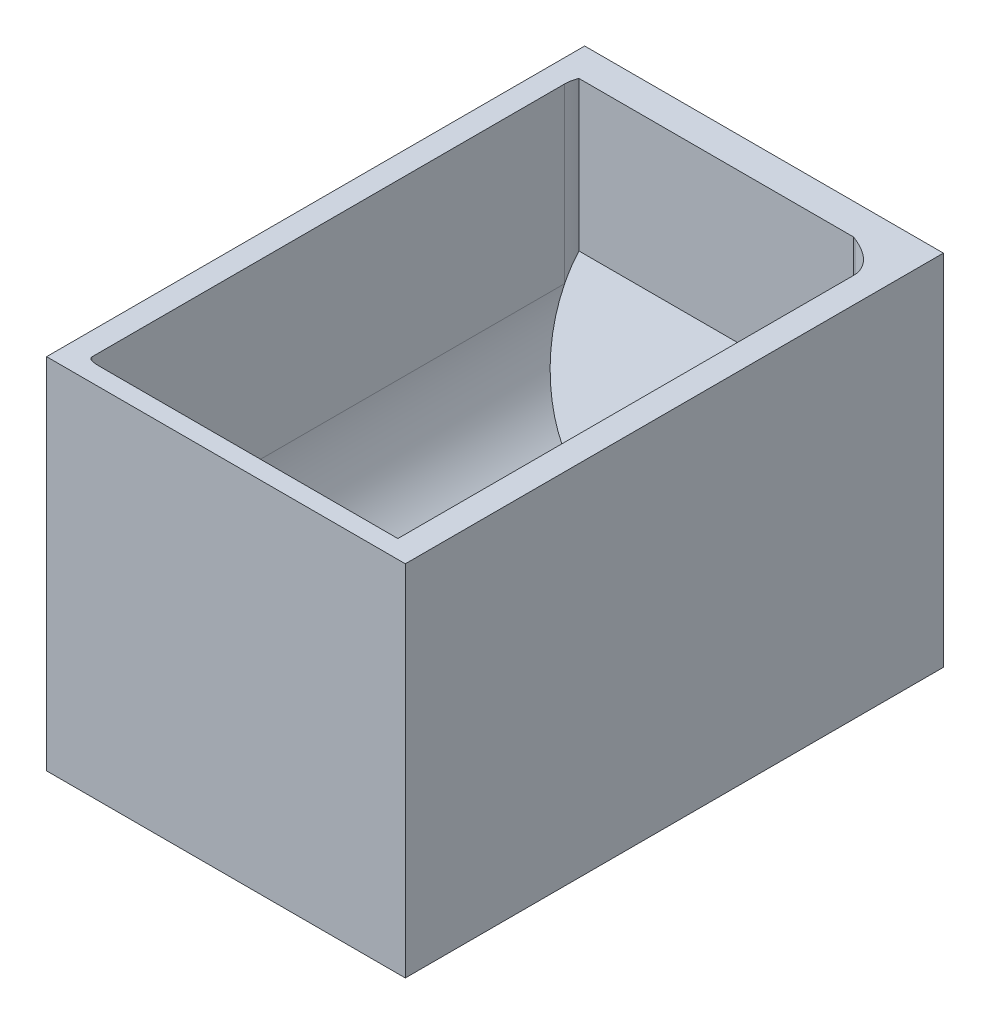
ISO-10303-21;
HEADER;
FILE_DESCRIPTION(('STEP AP214'),'2;1');
FILE_NAME('part.step','',(''),(''),'','','');
FILE_SCHEMA(('AUTOMOTIVE_DESIGN { 1 0 10303 214 1 1 1 1 }'));
ENDSEC;
DATA;
#1=APPLICATION_CONTEXT('core data for automotive mechanical design processes');
#2=APPLICATION_PROTOCOL_DEFINITION('international standard','automotive_design',2000,#1);
#3=PRODUCT_CONTEXT('',#1,'mechanical');
#4=PRODUCT('Part','Part','',(#3));
#5=PRODUCT_RELATED_PRODUCT_CATEGORY('part','',(#4));
#6=PRODUCT_DEFINITION_FORMATION('','',#4);
#7=PRODUCT_DEFINITION_CONTEXT('part definition',#1,'design');
#8=PRODUCT_DEFINITION('design','',#6,#7);
#9=PRODUCT_DEFINITION_SHAPE('','',#8);
#10=(LENGTH_UNIT() NAMED_UNIT(*) SI_UNIT(.MILLI.,.METRE.));
#11=(NAMED_UNIT(*) PLANE_ANGLE_UNIT() SI_UNIT($,.RADIAN.));
#12=(NAMED_UNIT(*) SI_UNIT($,.STERADIAN.) SOLID_ANGLE_UNIT());
#13=UNCERTAINTY_MEASURE_WITH_UNIT(LENGTH_MEASURE(1.E-05),#10,'distance_accuracy_value','');
#14=(GEOMETRIC_REPRESENTATION_CONTEXT(3) GLOBAL_UNCERTAINTY_ASSIGNED_CONTEXT((#13)) GLOBAL_UNIT_ASSIGNED_CONTEXT((#10,
#11,#12)) REPRESENTATION_CONTEXT('',''));
#15=CARTESIAN_POINT('',(0.,0.,0.));
#16=DIRECTION('',(0.,0.,1.));
#17=DIRECTION('',(1.,0.,0.));
#18=AXIS2_PLACEMENT_3D('',#15,#16,#17);
#19=CARTESIAN_POINT('',(42.6472601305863,-13.0230460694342,69.9501499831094));
#20=DIRECTION('',(0.,0.,-1.));
#21=DIRECTION('',(-1.,0.,0.));
#22=AXIS2_PLACEMENT_3D('',#19,#20,#21);
#23=PLANE('',#22);
#24=DIRECTION('',(0.,1.,0.));
#25=VECTOR('',#24,1.);
#26=CARTESIAN_POINT('',(-40.1719406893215,-13.0230460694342,69.9501499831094));
#27=LINE('',#26,#25);
#28=CARTESIAN_POINT('',(-40.1719406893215,-13.0230460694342,69.9501499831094));
#29=VERTEX_POINT('',#28);
#30=CARTESIAN_POINT('',(-40.1719406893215,50.,69.9501499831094));
#31=VERTEX_POINT('',#30);
#32=EDGE_CURVE('E118',#29,#31,#27,.T.);
#33=ORIENTED_EDGE('',*,*,#32,.T.);
#34=DIRECTION('',(1.,0.,0.));
#35=VECTOR('',#34,1.);
#36=CARTESIAN_POINT('',(-50.,50.,69.9501499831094));
#37=LINE('',#36,#35);
#38=CARTESIAN_POINT('',(42.6472601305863,50.,69.9501499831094));
#39=VERTEX_POINT('',#38);
#40=EDGE_CURVE('E243',#31,#39,#37,.T.);
#41=ORIENTED_EDGE('',*,*,#40,.T.);
#42=DIRECTION('',(0.,1.,0.));
#43=VECTOR('',#42,1.);
#44=CARTESIAN_POINT('',(42.6472601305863,-13.0230460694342,69.9501499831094));
#45=LINE('',#44,#43);
#46=CARTESIAN_POINT('',(42.6472601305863,-13.0230460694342,69.9501499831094));
#47=VERTEX_POINT('',#46);
#48=EDGE_CURVE('E114',#47,#39,#45,.T.);
#49=ORIENTED_EDGE('',*,*,#48,.F.);
#50=DIRECTION('',(1.,0.,0.));
#51=VECTOR('',#50,1.);
#52=CARTESIAN_POINT('',(0.,-13.0230460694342,69.9501499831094));
#53=LINE('',#52,#51);
#54=EDGE_CURVE('E270',#29,#47,#53,.T.);
#55=ORIENTED_EDGE('',*,*,#54,.F.);
#56=EDGE_LOOP('',(#33,#41,#49,#55));
#57=FACE_BOUND('',#56,.T.);
#58=ADVANCED_FACE('F41',(#57),#23,.T.);
#59=CARTESIAN_POINT('',(34.2275740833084,7.81878440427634,-66.1062454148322));
#60=CARTESIAN_POINT('',(39.7791899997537,3.48723255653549,-63.9094381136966));
#61=CARTESIAN_POINT('',(42.8680522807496,-2.84061940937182,-60.700179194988));
#62=CARTESIAN_POINT('',(42.8680522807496,-9.88212355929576,-57.1289815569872));
#63=(BOUNDED_CURVE() B_SPLINE_CURVE(3,(#59,#60,#61,#62),.UNSPECIFIED.,.F.,
.F.) B_SPLINE_CURVE_WITH_KNOTS((4,4),(0.,1.),
.UNSPECIFIED.) CURVE() GEOMETRIC_REPRESENTATION_ITEM() RATIONAL_B_SPLINE_CURVE((1.,
0.932433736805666,0.932433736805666,1.)) REPRESENTATION_ITEM(''));
#64=DIRECTION('',(0.,1.,0.));
#65=VECTOR('',#64,1.);
#66=SURFACE_OF_LINEAR_EXTRUSION('',#63,#65);
#67=DIRECTION('',(0.,1.,0.));
#68=VECTOR('',#67,1.);
#69=CARTESIAN_POINT('',(42.8680522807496,-9.88212355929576,-57.1289815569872));
#70=LINE('',#69,#68);
#71=CARTESIAN_POINT('',(42.8680522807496,-9.88212355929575,-57.1289815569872));
#72=VERTEX_POINT('',#71);
#73=CARTESIAN_POINT('',(42.8680522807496,50.,-57.1289815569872));
#74=VERTEX_POINT('',#73);
#75=EDGE_CURVE('E135',#72,#74,#70,.T.);
#76=ORIENTED_EDGE('',*,*,#75,.T.);
#77=CARTESIAN_POINT('',(42.8680522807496,50.,-57.1289815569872));
#78=CARTESIAN_POINT('',(42.8680548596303,50.,-57.2180878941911));
#79=CARTESIAN_POINT('',(42.8659892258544,50.,-57.3071810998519));
#80=CARTESIAN_POINT('',(42.8577508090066,50.,-57.4851717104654));
#81=CARTESIAN_POINT('',(42.8515782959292,50.,-57.5740691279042));
#82=CARTESIAN_POINT('',(42.826963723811,50.,-57.8400172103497));
#83=CARTESIAN_POINT('',(42.8024244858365,50.,-58.016539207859));
#84=CARTESIAN_POINT('',(42.7380327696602,50.,-58.3649748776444));
#85=CARTESIAN_POINT('',(42.6983289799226,50.,-58.5369164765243));
#86=CARTESIAN_POINT('',(42.6045419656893,50.,-58.8768520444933));
#87=CARTESIAN_POINT('',(42.5504559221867,50.,-59.0448452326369));
#88=CARTESIAN_POINT('',(42.4292826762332,50.,-59.375372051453));
#89=CARTESIAN_POINT('',(42.3622427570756,50.,-59.5379230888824));
#90=CARTESIAN_POINT('',(42.2163084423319,50.,-59.8575490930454));
#91=CARTESIAN_POINT('',(42.1374145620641,50.,-60.0146242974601));
#92=CARTESIAN_POINT('',(41.884474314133,50.,-60.4776783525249));
#93=CARTESIAN_POINT('',(41.6943483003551,50.,-60.7750139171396));
#94=CARTESIAN_POINT('',(41.3681110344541,50.,-61.2248383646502));
#95=CARTESIAN_POINT('',(41.2429815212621,50.,-61.3855839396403));
#96=CARTESIAN_POINT('',(40.9829813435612,50.,-61.6991890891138));
#97=CARTESIAN_POINT('',(40.8481051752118,50.,-61.8520441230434));
#98=CARTESIAN_POINT('',(40.5700103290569,50.,-62.1499763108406));
#99=CARTESIAN_POINT('',(40.4267899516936,50.,-62.2950518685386));
#100=CARTESIAN_POINT('',(40.1322700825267,50.,-62.5785682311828));
#101=CARTESIAN_POINT('',(39.9809269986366,50.,-62.7169636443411));
#102=CARTESIAN_POINT('',(39.6719875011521,50.,-62.986479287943));
#103=CARTESIAN_POINT('',(39.5143928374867,50.,-63.1176015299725));
#104=CARTESIAN_POINT('',(39.1937519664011,50.,-63.3729564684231));
#105=CARTESIAN_POINT('',(39.0307061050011,50.,-63.4971896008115));
#106=CARTESIAN_POINT('',(38.6261507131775,50.,-63.7930252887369));
#107=CARTESIAN_POINT('',(38.3820410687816,50.,-63.9610784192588));
#108=CARTESIAN_POINT('',(37.885522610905,50.,-64.2846038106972));
#109=CARTESIAN_POINT('',(37.6331102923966,50.,-64.4400706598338));
#110=CARTESIAN_POINT('',(37.1212831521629,50.,-64.7393526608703));
#111=CARTESIAN_POINT('',(36.8618641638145,50.,-64.8831606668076));
#112=CARTESIAN_POINT('',(36.3427907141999,50.,-65.1569158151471));
#113=CARTESIAN_POINT('',(36.0832560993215,50.,-65.2870909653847));
#114=CARTESIAN_POINT('',(35.5597029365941,50.,-65.5375327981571));
#115=CARTESIAN_POINT('',(35.2956878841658,50.,-65.6578068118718));
#116=CARTESIAN_POINT('',(34.7641919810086,50.,-65.888891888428));
#117=CARTESIAN_POINT('',(34.4967194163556,50.,-65.9997219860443));
#118=CARTESIAN_POINT('',(34.2275740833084,50.,-66.1062454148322));
#119=B_SPLINE_CURVE_WITH_KNOTS('',3,(#77,#78,#79,#80,#81,#82,#83,#84,#85,#86,#87,#88,#89,#90,
#91,#92,#93,#94,#95,#96,#97,#98,#99,#100,#101,#102,#103,#104,#105,#106,#107,#108,#109,#110,#111,
#112,#113,#114,#115,#116,#117,#118),.UNSPECIFIED.,.F.,.F.,(4,2,2,2,2,2,2,2,2,2,2,2,2,2,2,2,2,2,
2,2,4),(0.,0.267269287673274,0.53452100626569,1.06838041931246,1.59713440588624,
2.12599210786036,2.65295468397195,3.1798943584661,4.23527389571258,4.84610165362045,
5.45727707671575,6.068577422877,6.68357186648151,7.2983953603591,7.91317990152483,
8.80181136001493,9.69082290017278,10.5803752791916,11.4512073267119,12.3213886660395,
13.1897724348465),.UNSPECIFIED.);
#120=CARTESIAN_POINT('',(34.2275740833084,50.,-66.1062454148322));
#121=VERTEX_POINT('',#120);
#122=EDGE_CURVE('E521',#74,#121,#119,.T.);
#123=ORIENTED_EDGE('',*,*,#122,.T.);
#124=DIRECTION('',(0.,1.,0.));
#125=VECTOR('',#124,1.);
#126=CARTESIAN_POINT('',(34.2275740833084,7.81878440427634,-66.1062454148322));
#127=LINE('',#126,#125);
#128=CARTESIAN_POINT('',(34.2275740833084,7.81878440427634,-66.1062454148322));
#129=VERTEX_POINT('',#128);
#130=EDGE_CURVE('E132',#129,#121,#127,.T.);
#131=ORIENTED_EDGE('',*,*,#130,.F.);
#132=CARTESIAN_POINT('',(20.4167482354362,-9.88212355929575,-57.1289815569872));
#133=DIRECTION('',(0.,0.45231772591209,0.891856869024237));
#134=DIRECTION('',(0.,-0.891856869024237,0.45231772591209));
#135=AXIS2_PLACEMENT_3D('',#132,#133,#134);
#136=ELLIPSE('',#135,25.1736627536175,22.4513040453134);
#137=EDGE_CURVE('E115',#72,#129,#136,.T.);
#138=ORIENTED_EDGE('',*,*,#137,.F.);
#139=EDGE_LOOP('',(#76,#123,#131,#138));
#140=FACE_BOUND('',#139,.T.);
#141=ADVANCED_FACE('F450',(#140),#66,.T.);
#142=CARTESIAN_POINT('',(42.8680522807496,-9.88212355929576,-57.1289815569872));
#143=DIRECTION('',(-1.,0.,0.));
#144=DIRECTION('',(0.,0.,1.));
#145=AXIS2_PLACEMENT_3D('',#142,#143,#144);
#146=PLANE('',#145);
#147=DIRECTION('',(0.,1.,0.));
#148=VECTOR('',#147,1.);
#149=CARTESIAN_POINT('',(42.8680522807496,-9.88212355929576,69.8935790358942));
#150=LINE('',#149,#148);
#151=CARTESIAN_POINT('',(42.8680522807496,-9.88212355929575,69.8935790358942));
#152=VERTEX_POINT('',#151);
#153=CARTESIAN_POINT('',(42.8680522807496,50.,69.8935790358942));
#154=VERTEX_POINT('',#153);
#155=EDGE_CURVE('E137',#152,#154,#150,.T.);
#156=ORIENTED_EDGE('',*,*,#155,.T.);
#157=DIRECTION('',(0.,0.,-1.));
#158=VECTOR('',#157,1.);
#159=CARTESIAN_POINT('',(42.8680522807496,50.,75.));
#160=LINE('',#159,#158);
#161=EDGE_CURVE('E242',#154,#74,#160,.T.);
#162=ORIENTED_EDGE('',*,*,#161,.T.);
#163=ORIENTED_EDGE('',*,*,#75,.F.);
#164=DIRECTION('',(0.,0.,-1.));
#165=VECTOR('',#164,1.);
#166=CARTESIAN_POINT('',(42.8680522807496,-9.88212355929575,75.001));
#167=LINE('',#166,#165);
#168=EDGE_CURVE('E262',#152,#72,#167,.T.);
#169=ORIENTED_EDGE('',*,*,#168,.F.);
#170=EDGE_LOOP('',(#156,#162,#163,#169));
#171=FACE_BOUND('',#170,.T.);
#172=ADVANCED_FACE('F229',(#171),#146,.T.);
#173=CARTESIAN_POINT('',(33.5815636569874,8.34381436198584,-66.3725217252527));
#174=CARTESIAN_POINT('',(33.7934064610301,8.16453425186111,-66.2815973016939));
#175=CARTESIAN_POINT('',(34.0087716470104,7.98950120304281,-66.1928268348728));
#176=CARTESIAN_POINT('',(34.2275740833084,7.81878440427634,-66.1062454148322));
#177=(BOUNDED_CURVE() B_SPLINE_CURVE(3,(#173,#174,#175,#176),.UNSPECIFIED.,.F.,
.F.) B_SPLINE_CURVE_WITH_KNOTS((4,4),(0.,1.),
.UNSPECIFIED.) CURVE() GEOMETRIC_REPRESENTATION_ITEM() RATIONAL_B_SPLINE_CURVE((1.,
0.999868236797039,0.999868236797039,1.)) REPRESENTATION_ITEM(''));
#178=DIRECTION('',(0.,1.,0.));
#179=VECTOR('',#178,1.);
#180=SURFACE_OF_LINEAR_EXTRUSION('',#177,#179);
#181=ORIENTED_EDGE('',*,*,#130,.T.);
#182=CARTESIAN_POINT('',(34.2275740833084,50.,-66.1062454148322));
#183=CARTESIAN_POINT('',(34.1596857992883,50.,-66.1331093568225));
#184=CARTESIAN_POINT('',(34.091914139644,50.,-66.1602686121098));
#185=CARTESIAN_POINT('',(33.9501833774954,50.,-66.2177975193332));
#186=CARTESIAN_POINT('',(33.8762485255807,50.,-66.2482269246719));
#187=CARTESIAN_POINT('',(33.7286771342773,50.,-66.3098206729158));
#188=CARTESIAN_POINT('',(33.6550406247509,50.,-66.3409850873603));
#189=CARTESIAN_POINT('',(33.5815636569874,50.,-66.3725217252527));
#190=B_SPLINE_CURVE_WITH_KNOTS('',3,(#182,#183,#184,#185,#186,#187,#188,#189),.UNSPECIFIED.,.F.,
.F.,(4,2,2,4),(0.,0.219030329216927,0.45888223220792,0.698757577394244),.UNSPECIFIED.);
#191=CARTESIAN_POINT('',(33.5815636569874,50.,-66.3725217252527));
#192=VERTEX_POINT('',#191);
#193=EDGE_CURVE('E500',#121,#192,#190,.T.);
#194=ORIENTED_EDGE('',*,*,#193,.T.);
#195=DIRECTION('',(0.,1.,0.));
#196=VECTOR('',#195,1.);
#197=CARTESIAN_POINT('',(33.5815636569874,8.34381436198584,-66.3725217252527));
#198=LINE('',#197,#196);
#199=CARTESIAN_POINT('',(33.5815636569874,8.34381436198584,-66.3725217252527));
#200=VERTEX_POINT('',#199);
#201=EDGE_CURVE('E129',#200,#192,#198,.T.);
#202=ORIENTED_EDGE('',*,*,#201,.F.);
#203=CARTESIAN_POINT('',(47.1063341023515,24.3250924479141,-74.4776511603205));
#204=DIRECTION('',(0.,0.45231772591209,0.891856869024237));
#205=DIRECTION('',(0.,-0.891856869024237,0.45231772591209));
#206=AXIS2_PLACEMENT_3D('',#203,#204,#205);
#207=ELLIPSE('',#206,23.4747411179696,20.9361091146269);
#208=EDGE_CURVE('E101',#129,#200,#207,.F.);
#209=ORIENTED_EDGE('',*,*,#208,.F.);
#210=EDGE_LOOP('',(#181,#194,#202,#209));
#211=FACE_BOUND('',#210,.T.);
#212=ADVANCED_FACE('F439',(#211),#180,.T.);
#213=CARTESIAN_POINT('',(-42.9839007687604,8.34381436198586,-66.3725217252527));
#214=DIRECTION('',(0.,0.,1.));
#215=DIRECTION('',(1.,0.,0.));
#216=AXIS2_PLACEMENT_3D('',#213,#214,#215);
#217=PLANE('',#216);
#218=ORIENTED_EDGE('',*,*,#201,.T.);
#219=DIRECTION('',(-1.,0.,0.));
#220=VECTOR('',#219,1.);
#221=CARTESIAN_POINT('',(-50.,50.,-66.3725217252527));
#222=LINE('',#221,#220);
#223=CARTESIAN_POINT('',(-42.9839007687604,50.,-66.3725217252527));
#224=VERTEX_POINT('',#223);
#225=EDGE_CURVE('E499',#192,#224,#222,.T.);
#226=ORIENTED_EDGE('',*,*,#225,.T.);
#227=DIRECTION('',(0.,1.,0.));
#228=VECTOR('',#227,1.);
#229=CARTESIAN_POINT('',(-42.9839007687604,8.34381436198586,-66.3725217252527));
#230=LINE('',#229,#228);
#231=CARTESIAN_POINT('',(-42.9839007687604,8.34381436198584,-66.3725217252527));
#232=VERTEX_POINT('',#231);
#233=EDGE_CURVE('E74',#232,#224,#230,.T.);
#234=ORIENTED_EDGE('',*,*,#233,.F.);
#235=DIRECTION('',(1.,0.,0.));
#236=VECTOR('',#235,1.);
#237=CARTESIAN_POINT('',(0.,8.34381436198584,-66.3725217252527));
#238=LINE('',#237,#236);
#239=EDGE_CURVE('E246',#232,#200,#238,.T.);
#240=ORIENTED_EDGE('',*,*,#239,.T.);
#241=EDGE_LOOP('',(#218,#226,#234,#240));
#242=FACE_BOUND('',#241,.T.);
#243=ADVANCED_FACE('F430',(#242),#217,.T.);
#244=CARTESIAN_POINT('',(-43.634459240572,1.78443318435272,-63.0458395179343));
#245=CARTESIAN_POINT('',(-43.634459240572,3.98879593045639,-64.1638130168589));
#246=CARTESIAN_POINT('',(-43.4168982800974,6.18239624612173,-65.2763281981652));
#247=CARTESIAN_POINT('',(-42.9839007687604,8.34381436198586,-66.3725217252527));
#248=(BOUNDED_CURVE() B_SPLINE_CURVE(3,(#244,#245,#246,#247),.UNSPECIFIED.,.F.,
.F.) B_SPLINE_CURVE_WITH_KNOTS((4,4),(0.,1.),
.UNSPECIFIED.) CURVE() GEOMETRIC_REPRESENTATION_ITEM() RATIONAL_B_SPLINE_CURVE((1.,
0.996745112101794,0.996745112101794,1.)) REPRESENTATION_ITEM(''));
#249=DIRECTION('',(0.,1.,0.));
#250=VECTOR('',#249,1.);
#251=SURFACE_OF_LINEAR_EXTRUSION('',#248,#250);
#252=ORIENTED_EDGE('',*,*,#233,.T.);
#253=CARTESIAN_POINT('',(-42.9839007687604,50.,-66.3725217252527));
#254=CARTESIAN_POINT('',(-43.0351918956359,50.,-66.2426697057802));
#255=CARTESIAN_POINT('',(-43.083773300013,50.,-66.1117684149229));
#256=CARTESIAN_POINT('',(-43.1752733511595,50.,-65.8479615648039));
#257=CARTESIAN_POINT('',(-43.2181903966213,50.,-65.7150554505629));
#258=CARTESIAN_POINT('',(-43.337966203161,50.,-65.3138247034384));
#259=CARTESIAN_POINT('',(-43.4059435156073,50.,-65.0427518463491));
#260=CARTESIAN_POINT('',(-43.4895740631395,50.,-64.6281417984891));
#261=CARTESIAN_POINT('',(-43.5146232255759,50.,-64.4864260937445));
#262=CARTESIAN_POINT('',(-43.5577474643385,50.,-64.2019604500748));
#263=CARTESIAN_POINT('',(-43.5758244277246,50.,-64.0592108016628));
#264=CARTESIAN_POINT('',(-43.6050048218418,50.,-63.7715780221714));
#265=CARTESIAN_POINT('',(-43.6160376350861,50.,-63.6266877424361));
#266=CARTESIAN_POINT('',(-43.630771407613,50.,-63.3364797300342));
#267=CARTESIAN_POINT('',(-43.6344695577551,50.,-63.1911618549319));
#268=CARTESIAN_POINT('',(-43.634459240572,50.0000000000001,-63.0458395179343));
#269=B_SPLINE_CURVE_WITH_KNOTS('',3,(#253,#254,#255,#256,#257,#258,#259,#260,#261,#262,#263,
#264,#265,#266,#267,#268),.UNSPECIFIED.,.F.,.F.,(4,2,2,2,2,2,2,4),(0.,0.418770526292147,
0.837659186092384,1.67467753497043,2.10627941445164,2.53776439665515,2.9735097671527,
3.40942199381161),.UNSPECIFIED.);
#270=CARTESIAN_POINT('',(-43.634459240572,50.,-63.0458395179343));
#271=VERTEX_POINT('',#270);
#272=EDGE_CURVE('E498',#224,#271,#269,.T.);
#273=ORIENTED_EDGE('',*,*,#272,.T.);
#274=DIRECTION('',(0.,1.,0.));
#275=VECTOR('',#274,1.);
#276=CARTESIAN_POINT('',(-43.634459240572,1.78443318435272,-63.0458395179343));
#277=LINE('',#276,#275);
#278=CARTESIAN_POINT('',(-43.634459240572,1.78443318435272,-63.0458395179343));
#279=VERTEX_POINT('',#278);
#280=EDGE_CURVE('E57',#279,#271,#277,.T.);
#281=ORIENTED_EDGE('',*,*,#280,.F.);
#282=CARTESIAN_POINT('',(-10.2410675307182,1.78443318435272,-63.0458395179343));
#283=DIRECTION('',(0.,0.45231772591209,0.891856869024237));
#284=DIRECTION('',(0.,-0.891856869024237,0.45231772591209));
#285=AXIS2_PLACEMENT_3D('',#282,#283,#284);
#286=ELLIPSE('',#285,37.4425458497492,33.3933917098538);
#287=EDGE_CURVE('E97',#232,#279,#286,.T.);
#288=ORIENTED_EDGE('',*,*,#287,.F.);
#289=EDGE_LOOP('',(#252,#273,#281,#288));
#290=FACE_BOUND('',#289,.T.);
#291=ADVANCED_FACE('F421',(#290),#251,.T.);
#292=CARTESIAN_POINT('',(-43.634459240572,1.78443318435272,68.684061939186));
#293=DIRECTION('',(1.,0.,0.));
#294=DIRECTION('',(0.,0.,-1.));
#295=AXIS2_PLACEMENT_3D('',#292,#293,#294);
#296=PLANE('',#295);
#297=ORIENTED_EDGE('',*,*,#280,.T.);
#298=DIRECTION('',(0.,0.,1.));
#299=VECTOR('',#298,1.);
#300=CARTESIAN_POINT('',(-43.634459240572,50.,75.));
#301=LINE('',#300,#299);
#302=CARTESIAN_POINT('',(-43.634459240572,50.,68.684061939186));
#303=VERTEX_POINT('',#302);
#304=EDGE_CURVE('E153',#271,#303,#301,.T.);
#305=ORIENTED_EDGE('',*,*,#304,.T.);
#306=DIRECTION('',(0.,1.,0.));
#307=VECTOR('',#306,1.);
#308=CARTESIAN_POINT('',(-43.634459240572,1.78443318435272,68.684061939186));
#309=LINE('',#308,#307);
#310=CARTESIAN_POINT('',(-43.634459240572,1.78443318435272,68.684061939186));
#311=VERTEX_POINT('',#310);
#312=EDGE_CURVE('E11',#311,#303,#309,.T.);
#313=ORIENTED_EDGE('',*,*,#312,.F.);
#314=DIRECTION('',(0.,0.,1.));
#315=VECTOR('',#314,1.);
#316=CARTESIAN_POINT('',(-43.634459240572,1.78443318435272,75.001));
#317=LINE('',#316,#315);
#318=EDGE_CURVE('E152',#279,#311,#317,.T.);
#319=ORIENTED_EDGE('',*,*,#318,.F.);
#320=EDGE_LOOP('',(#297,#305,#313,#319));
#321=FACE_BOUND('',#320,.T.);
#322=ADVANCED_FACE('F161',(#321),#296,.T.);
#323=CARTESIAN_POINT('',(-40.1719406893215,-13.0230460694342,69.9501499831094));
#324=CARTESIAN_POINT('',(-41.3105669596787,-10.7215011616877,69.9501499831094));
#325=CARTESIAN_POINT('',(-42.1749392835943,-8.31507947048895,69.8594662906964));
#326=CARTESIAN_POINT('',(-42.9075617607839,-5.17506547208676,69.598653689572));
#327=CARTESIAN_POINT('',(-43.0364207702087,-4.53980138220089,69.5389659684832));
#328=CARTESIAN_POINT('',(-43.2553536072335,-3.27403020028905,69.4059453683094));
#329=CARTESIAN_POINT('',(-43.346006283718,-2.64128852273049,69.3324481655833));
#330=CARTESIAN_POINT('',(-43.5629706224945,-0.74358472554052,69.0908770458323));
#331=CARTESIAN_POINT('',(-43.634459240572,0.520849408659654,68.9017344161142));
#332=CARTESIAN_POINT('',(-43.634459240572,1.78443318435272,68.684061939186));
#333=B_SPLINE_CURVE_WITH_KNOTS('',3,(#323,#324,#325,#326,#327,#328,#329,#330,#331,#332),
.UNSPECIFIED.,.F.,.F.,(4,2,2,2,4),(0.,0.500000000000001,0.625000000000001,0.750000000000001,1.),.UNSPECIFIED.);
#334=DIRECTION('',(0.,1.,0.));
#335=VECTOR('',#334,1.);
#336=SURFACE_OF_LINEAR_EXTRUSION('',#333,#335);
#337=ORIENTED_EDGE('',*,*,#312,.T.);
#338=CARTESIAN_POINT('',(-43.634459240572,50.,68.684061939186));
#339=CARTESIAN_POINT('',(-43.6344639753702,50.,68.707674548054));
#340=CARTESIAN_POINT('',(-43.6336181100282,50.,68.7312975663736));
#341=CARTESIAN_POINT('',(-43.6301052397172,50.,68.7784283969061));
#342=CARTESIAN_POINT('',(-43.6274365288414,50.,68.8019360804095));
#343=CARTESIAN_POINT('',(-43.6201642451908,50.,68.848612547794));
#344=CARTESIAN_POINT('',(-43.6155642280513,50.,68.8717818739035));
#345=CARTESIAN_POINT('',(-43.6043783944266,50.,68.9176219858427));
#346=CARTESIAN_POINT('',(-43.5977932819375,50.,68.9402929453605));
#347=CARTESIAN_POINT('',(-43.5749453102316,50.,69.0075124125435));
#348=CARTESIAN_POINT('',(-43.5556199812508,50.,69.0510664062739));
#349=CARTESIAN_POINT('',(-43.50966392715,50.,69.133996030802));
#350=CARTESIAN_POINT('',(-43.4830405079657,50.,69.173375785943));
#351=CARTESIAN_POINT('',(-43.4163314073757,50.,69.2570016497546));
#352=CARTESIAN_POINT('',(-43.3745446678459,50.,69.2998795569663));
#353=CARTESIAN_POINT('',(-43.2846817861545,50.,69.378513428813));
#354=CARTESIAN_POINT('',(-43.2365857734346,50.,69.4142459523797));
#355=CARTESIAN_POINT('',(-43.1424220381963,50.,69.4756323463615));
#356=CARTESIAN_POINT('',(-43.0967953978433,50.,69.5019797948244));
#357=CARTESIAN_POINT('',(-43.0034407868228,50.,69.5506925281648));
#358=CARTESIAN_POINT('',(-42.9557110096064,50.,69.5730543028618));
#359=CARTESIAN_POINT('',(-42.858456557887,50.,69.6146252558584));
#360=CARTESIAN_POINT('',(-42.8089204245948,50.,69.633807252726));
#361=CARTESIAN_POINT('',(-42.7088878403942,50.,69.6693420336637));
#362=CARTESIAN_POINT('',(-42.658391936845,50.,69.685696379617));
#363=CARTESIAN_POINT('',(-42.5055863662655,50.,69.7313486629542));
#364=CARTESIAN_POINT('',(-42.4022275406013,50.,69.7571279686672));
#365=CARTESIAN_POINT('',(-42.1939435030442,50.,69.8019162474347));
#366=CARTESIAN_POINT('',(-42.0890159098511,50.,69.8209135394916));
#367=CARTESIAN_POINT('',(-41.8780643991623,50.,69.8538220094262));
#368=CARTESIAN_POINT('',(-41.7720381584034,50.,69.867717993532));
#369=CARTESIAN_POINT('',(-41.5593371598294,50.,69.8915348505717));
#370=CARTESIAN_POINT('',(-41.4526615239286,50.,69.9014476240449));
#371=CARTESIAN_POINT('',(-41.2476248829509,50.,69.9174176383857));
#372=CARTESIAN_POINT('',(-41.1492824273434,50.,69.9237201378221));
#373=CARTESIAN_POINT('',(-40.9527040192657,50.,69.9340875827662));
#374=CARTESIAN_POINT('',(-40.8544683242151,50.,69.9381575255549));
#375=CARTESIAN_POINT('',(-40.6584511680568,50.,69.9444303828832));
#376=CARTESIAN_POINT('',(-40.5606700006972,50.,69.9466428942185));
#377=CARTESIAN_POINT('',(-40.3659045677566,50.,69.9494912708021));
#378=CARTESIAN_POINT('',(-40.2689204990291,50.,69.9501402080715));
#379=CARTESIAN_POINT('',(-40.1719406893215,50.,69.9501499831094));
#380=B_SPLINE_CURVE_WITH_KNOTS('',3,(#338,#339,#340,#341,#342,#343,#344,#345,#346,#347,#348,
#349,#350,#351,#352,#353,#354,#355,#356,#357,#358,#359,#360,#361,#362,#363,#364,#365,#366,#367,
#368,#369,#370,#371,#372,#373,#374,#375,#376,#377,#378,#379),.UNSPECIFIED.,.F.,.F.,(4,2,2,2,2,2,
2,2,2,2,2,2,2,2,2,2,2,2,2,2,4),(0.,0.0708376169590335,0.141741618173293,0.212515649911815,
0.28326461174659,0.425363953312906,0.567321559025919,0.74592669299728,0.925108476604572,
1.08294175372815,1.24091335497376,1.40017253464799,1.55934346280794,1.87855017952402,
2.19830405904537,2.51900271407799,2.84035021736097,3.13595341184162,3.43089220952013,
3.7242976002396,4.01524137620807),.UNSPECIFIED.);
#381=EDGE_CURVE('E144',#303,#31,#380,.T.);
#382=ORIENTED_EDGE('',*,*,#381,.T.);
#383=ORIENTED_EDGE('',*,*,#32,.F.);
#384=CARTESIAN_POINT('',(-40.1719406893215,-13.0230460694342,69.9501499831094));
#385=CARTESIAN_POINT('',(-41.3105669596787,-10.7215011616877,69.9501499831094));
#386=CARTESIAN_POINT('',(-42.1749392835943,-8.31507947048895,69.8594662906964));
#387=CARTESIAN_POINT('',(-42.9075617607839,-5.17506547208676,69.598653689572));
#388=CARTESIAN_POINT('',(-43.0364207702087,-4.53980138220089,69.5389659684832));
#389=CARTESIAN_POINT('',(-43.2553536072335,-3.27403020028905,69.4059453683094));
#390=CARTESIAN_POINT('',(-43.346006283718,-2.64128852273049,69.3324481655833));
#391=CARTESIAN_POINT('',(-43.5629706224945,-0.74358472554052,69.0908770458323));
#392=CARTESIAN_POINT('',(-43.634459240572,0.520849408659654,68.9017344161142));
#393=CARTESIAN_POINT('',(-43.634459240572,1.78443318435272,68.684061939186));
#394=B_SPLINE_CURVE_WITH_KNOTS('',3,(#384,#385,#386,#387,#388,#389,#390,#391,#392,#393),
.UNSPECIFIED.,.F.,.F.,(4,2,2,2,4),(0.,0.500000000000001,0.625000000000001,0.750000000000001,1.),.UNSPECIFIED.);
#395=EDGE_CURVE('E195',#29,#311,#394,.T.);
#396=ORIENTED_EDGE('',*,*,#395,.T.);
#397=EDGE_LOOP('',(#337,#382,#383,#396));
#398=FACE_BOUND('',#397,.T.);
#399=ADVANCED_FACE('F155',(#398),#336,.T.);
#400=CARTESIAN_POINT('',(42.8680522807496,-9.88212355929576,69.8935790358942));
#401=CARTESIAN_POINT('',(42.8680522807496,-10.4035724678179,69.912368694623));
#402=CARTESIAN_POINT('',(42.8499090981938,-10.9263121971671,69.9265202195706));
#403=CARTESIAN_POINT('',(42.7765179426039,-11.9744272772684,69.9454213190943));
#404=CARTESIAN_POINT('',(42.7208989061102,-12.5018527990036,69.9501499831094));
#405=CARTESIAN_POINT('',(42.6472601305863,-13.0230460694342,69.9501499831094));
#406=B_SPLINE_CURVE_WITH_KNOTS('',3,(#400,#401,#402,#403,#404,#405),.UNSPECIFIED.,.F.,.F.,(4,2,
4),(0.,0.5,1.),.UNSPECIFIED.);
#407=DIRECTION('',(0.,1.,0.));
#408=VECTOR('',#407,1.);
#409=SURFACE_OF_LINEAR_EXTRUSION('',#406,#408);
#410=ORIENTED_EDGE('',*,*,#48,.T.);
#411=CARTESIAN_POINT('',(42.6472601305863,50.,69.9501499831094));
#412=CARTESIAN_POINT('',(42.6611223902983,50.,69.9501327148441));
#413=CARTESIAN_POINT('',(42.6749922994,50.,69.949979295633));
#414=CARTESIAN_POINT('',(42.7027540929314,50.,69.9492086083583));
#415=CARTESIAN_POINT('',(42.7166459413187,50.,69.9485901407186));
#416=CARTESIAN_POINT('',(42.7422538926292,50.,69.9468415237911));
#417=CARTESIAN_POINT('',(42.7539761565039,50.,69.9458046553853));
#418=CARTESIAN_POINT('',(42.7773516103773,50.,69.9430223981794));
#419=CARTESIAN_POINT('',(42.7890047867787,49.9999999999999,69.9412768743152));
#420=CARTESIAN_POINT('',(42.8067120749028,50.,69.9376173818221));
#421=CARTESIAN_POINT('',(42.8128571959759,50.,69.936156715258));
#422=CARTESIAN_POINT('',(42.8249819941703,50.,69.9326844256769));
#423=CARTESIAN_POINT('',(42.8309620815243,50.,69.9306743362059));
#424=CARTESIAN_POINT('',(42.8419047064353,50.,69.9260369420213));
#425=CARTESIAN_POINT('',(42.8469056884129,50.,69.9235056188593));
#426=CARTESIAN_POINT('',(42.8554782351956,50.,69.9176651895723));
#427=CARTESIAN_POINT('',(42.8591517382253,50.,69.9145286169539));
#428=CARTESIAN_POINT('',(42.8639851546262,50.,69.9082132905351));
#429=CARTESIAN_POINT('',(42.8655746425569,50.,69.9053934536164));
#430=CARTESIAN_POINT('',(42.8670917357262,50.,69.9009790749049));
#431=CARTESIAN_POINT('',(42.8674536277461,50.,69.8995289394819));
#432=CARTESIAN_POINT('',(42.8679361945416,50.,69.8965787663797));
#433=CARTESIAN_POINT('',(42.8680552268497,49.9999999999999,69.8950784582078));
#434=CARTESIAN_POINT('',(42.8680522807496,49.9999999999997,69.8935790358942));
#435=B_SPLINE_CURVE_WITH_KNOTS('',3,(#411,#412,#413,#414,#415,#416,#417,#418,#419,#420,#421,
#422,#423,#424,#425,#426,#427,#428,#429,#430,#431,#432,#433,#434),.UNSPECIFIED.,.F.,.F.,(4,2,2,
2,2,2,2,2,2,2,2,4),(0.,0.0415988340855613,0.0833053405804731,0.118600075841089,
0.153901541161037,0.172836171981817,0.191718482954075,0.208457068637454,0.222696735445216,
0.232214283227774,0.236678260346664,0.241172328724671),.UNSPECIFIED.);
#436=EDGE_CURVE('E234',#39,#154,#435,.T.);
#437=ORIENTED_EDGE('',*,*,#436,.T.);
#438=ORIENTED_EDGE('',*,*,#155,.F.);
#439=CARTESIAN_POINT('',(42.8680522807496,-9.88212355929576,69.8935790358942));
#440=CARTESIAN_POINT('',(42.8680522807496,-10.4035724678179,69.912368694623));
#441=CARTESIAN_POINT('',(42.8499090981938,-10.9263121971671,69.9265202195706));
#442=CARTESIAN_POINT('',(42.7765179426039,-11.9744272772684,69.9454213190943));
#443=CARTESIAN_POINT('',(42.7208989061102,-12.5018527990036,69.9501499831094));
#444=CARTESIAN_POINT('',(42.6472601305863,-13.0230460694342,69.9501499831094));
#445=B_SPLINE_CURVE_WITH_KNOTS('',3,(#439,#440,#441,#442,#443,#444),.UNSPECIFIED.,.F.,.F.,(4,2,
4),(0.,0.5,1.),.UNSPECIFIED.);
#446=EDGE_CURVE('E203',#152,#47,#445,.T.);
#447=ORIENTED_EDGE('',*,*,#446,.T.);
#448=EDGE_LOOP('',(#410,#437,#438,#447));
#449=FACE_BOUND('',#448,.T.);
#450=ADVANCED_FACE('F160',(#449),#409,.T.);
#451=CARTESIAN_POINT('',(0.,-13.0230460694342,-17.2730182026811));
#452=DIRECTION('',(1.,0.,0.));
#453=DIRECTION('',(0.,0.,-1.));
#454=AXIS2_PLACEMENT_3D('',#451,#452,#453);
#455=CYLINDRICAL_SURFACE('',#454,87.2231681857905);
#456=CARTESIAN_POINT('',(-11.0266635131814,-31.5997164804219,67.948976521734));
#457=CARTESIAN_POINT('',(-11.4924902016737,-31.588755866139,67.9513601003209));
#458=CARTESIAN_POINT('',(-11.9580225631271,-31.5680431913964,67.9558791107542));
#459=CARTESIAN_POINT('',(-12.8877391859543,-31.5071689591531,67.9691041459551));
#460=CARTESIAN_POINT('',(-13.3519234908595,-31.4670080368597,67.9778100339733));
#461=CARTESIAN_POINT('',(-14.7410045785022,-31.3174720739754,68.0100744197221));
#462=CARTESIAN_POINT('',(-15.6627890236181,-31.1790353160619,68.0397816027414));
#463=CARTESIAN_POINT('',(-17.4894459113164,-30.8260490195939,68.1141385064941));
#464=CARTESIAN_POINT('',(-18.3943438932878,-30.6116262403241,68.1587633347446));
#465=CARTESIAN_POINT('',(-19.7351793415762,-30.2342522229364,68.2352953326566));
#466=CARTESIAN_POINT('',(-20.1793976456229,-30.0991615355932,68.2624069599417));
#467=CARTESIAN_POINT('',(-21.0617617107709,-29.8106090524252,68.319507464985));
#468=CARTESIAN_POINT('',(-21.4999059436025,-29.6571427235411,68.3494970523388));
#469=CARTESIAN_POINT('',(-22.8036777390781,-29.1697260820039,68.4432322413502));
#470=CARTESIAN_POINT('',(-23.6590499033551,-28.8086438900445,68.5107679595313));
#471=CARTESIAN_POINT('',(-25.3363068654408,-28.0167827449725,68.6527085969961));
#472=CARTESIAN_POINT('',(-26.1581911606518,-27.5860027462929,68.727113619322));
#473=CARTESIAN_POINT('',(-27.3618201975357,-26.8898329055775,68.8411416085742));
#474=CARTESIAN_POINT('',(-27.7582707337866,-26.6493685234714,68.8795654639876));
#475=CARTESIAN_POINT('',(-28.5406958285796,-26.1522274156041,68.9567269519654));
#476=CARTESIAN_POINT('',(-28.926673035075,-25.8955548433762,68.9954645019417));
#477=CARTESIAN_POINT('',(-30.0681583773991,-25.1016955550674,69.1114327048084));
#478=CARTESIAN_POINT('',(-30.8072847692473,-24.5406299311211,69.1884251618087));
#479=CARTESIAN_POINT('',(-32.246783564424,-23.3502464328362,69.3387303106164));
#480=CARTESIAN_POINT('',(-32.9464453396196,-22.7200626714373,69.4119741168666));
#481=CARTESIAN_POINT('',(-34.2905574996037,-21.4023361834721,69.5492556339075));
#482=CARTESIAN_POINT('',(-34.9350071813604,-20.7147927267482,69.6132932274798));
#483=CARTESIAN_POINT('',(-36.1639900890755,-19.2870615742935,69.7278779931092));
#484=CARTESIAN_POINT('',(-36.7485249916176,-18.5468753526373,69.7784255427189));
#485=CARTESIAN_POINT('',(-37.8533189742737,-17.0190452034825,69.8619242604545));
#486=CARTESIAN_POINT('',(-38.3735794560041,-16.2314023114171,69.8948758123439));
#487=CARTESIAN_POINT('',(-39.3389419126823,-14.6258478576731,69.9390670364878));
#488=CARTESIAN_POINT('',(-39.7850005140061,-13.8085199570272,69.9506064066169));
#489=CARTESIAN_POINT('',(-40.6073179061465,-12.139462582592,69.9496659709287));
#490=CARTESIAN_POINT('',(-40.9835772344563,-11.2877333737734,69.9371863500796));
#491=CARTESIAN_POINT('',(-41.6633360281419,-9.55681441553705,69.8855479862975));
#492=CARTESIAN_POINT('',(-41.9668597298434,-8.67763392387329,69.8463981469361));
#493=CARTESIAN_POINT('',(-42.4991635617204,-6.89864234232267,69.7394328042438));
#494=CARTESIAN_POINT('',(-42.7279462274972,-5.99883195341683,69.6716182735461));
#495=CARTESIAN_POINT('',(-43.1015179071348,-4.22369390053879,69.5095465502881));
#496=CARTESIAN_POINT('',(-43.2494055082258,-3.34890522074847,69.4165069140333));
#497=CARTESIAN_POINT('',(-43.4749283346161,-1.59372300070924,69.2026035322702));
#498=CARTESIAN_POINT('',(-43.5525657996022,-0.713329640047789,69.0817406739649));
#499=CARTESIAN_POINT('',(-43.6379306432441,1.04661852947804,68.8125097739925));
#500=CARTESIAN_POINT('',(-43.6456576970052,1.92617333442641,68.6641416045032));
#501=CARTESIAN_POINT('',(-43.5922325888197,3.67827255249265,68.3408864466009));
#502=CARTESIAN_POINT('',(-43.5310793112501,4.55081685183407,68.1659990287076));
#503=CARTESIAN_POINT('',(-43.3413151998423,6.2849534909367,67.7909044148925));
#504=CARTESIAN_POINT('',(-43.2125616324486,7.14651869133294,67.5906443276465));
#505=CARTESIAN_POINT('',(-42.8896170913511,8.85151938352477,67.1672335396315));
#506=CARTESIAN_POINT('',(-42.6954264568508,9.694954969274,66.9440829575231));
#507=CARTESIAN_POINT('',(-42.243999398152,11.3591080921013,66.4774359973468));
#508=CARTESIAN_POINT('',(-41.9867543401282,12.1798225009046,66.2339368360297));
#509=CARTESIAN_POINT('',(-41.4118302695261,13.7942846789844,65.7295554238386));
#510=CARTESIAN_POINT('',(-41.0941485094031,14.5880312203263,65.4686723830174));
#511=CARTESIAN_POINT('',(-40.3759056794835,16.2012679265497,64.913354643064));
#512=CARTESIAN_POINT('',(-39.9710105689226,17.0184642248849,64.6178581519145));
#513=CARTESIAN_POINT('',(-39.0979759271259,18.6137032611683,64.0148925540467));
#514=CARTESIAN_POINT('',(-38.629833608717,19.3917442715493,63.7074229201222));
#515=CARTESIAN_POINT('',(-37.6329930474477,20.9057061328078,63.0848765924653));
#516=CARTESIAN_POINT('',(-37.1042502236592,21.6415953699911,62.7697944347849));
#517=CARTESIAN_POINT('',(-35.989351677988,23.0673730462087,62.1371267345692));
#518=CARTESIAN_POINT('',(-35.4031940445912,23.7572599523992,61.8195411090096));
#519=CARTESIAN_POINT('',(-34.1240898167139,25.144306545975,61.1602191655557));
#520=CARTESIAN_POINT('',(-33.4263027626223,25.8371243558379,60.8187179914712));
#521=CARTESIAN_POINT('',(-31.9695313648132,27.16082328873,60.1459013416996));
#522=CARTESIAN_POINT('',(-31.2105398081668,27.7916970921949,59.8145870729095));
#523=CARTESIAN_POINT('',(-29.6350760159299,28.9867911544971,59.1698723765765));
#524=CARTESIAN_POINT('',(-28.8186247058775,29.5510354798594,58.8564655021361));
#525=CARTESIAN_POINT('',(-27.1318763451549,30.6081962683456,58.2555556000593));
#526=CARTESIAN_POINT('',(-26.2615923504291,31.101129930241,57.9680463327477));
#527=CARTESIAN_POINT('',(-24.63045414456,31.9298530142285,57.4752758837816));
#528=CARTESIAN_POINT('',(-23.877538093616,32.2780101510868,57.2644683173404));
#529=CARTESIAN_POINT('',(-22.3415126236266,32.9194665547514,56.8708169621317));
#530=CARTESIAN_POINT('',(-21.558403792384,33.2127668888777,56.6879726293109));
#531=CARTESIAN_POINT('',(-19.9677400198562,33.7408305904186,56.3552250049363));
#532=CARTESIAN_POINT('',(-19.1602394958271,33.9757148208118,56.2052537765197));
#533=CARTESIAN_POINT('',(-17.5242766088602,34.384796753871,55.9419865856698));
#534=CARTESIAN_POINT('',(-16.6958219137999,34.559016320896,55.8286774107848));
#535=CARTESIAN_POINT('',(-15.3981476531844,34.7805372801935,55.6838671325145));
#536=CARTESIAN_POINT('',(-14.9340820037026,34.8497453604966,55.6384482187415));
#537=CARTESIAN_POINT('',(-14.0024111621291,34.9686362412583,55.5602475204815));
#538=CARTESIAN_POINT('',(-13.5348063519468,35.0183211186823,55.5274643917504));
#539=CARTESIAN_POINT('',(-12.5968574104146,35.0979513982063,55.4748550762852));
#540=CARTESIAN_POINT('',(-12.1265115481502,35.127882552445,55.4550382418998));
#541=CARTESIAN_POINT('',(-11.1844701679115,35.1678304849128,55.4285676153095));
#542=CARTESIAN_POINT('',(-10.7127742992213,35.1778415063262,55.4219176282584));
#543=CARTESIAN_POINT('',(-10.2410675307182,35.1778248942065,55.421941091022));
#544=B_SPLINE_CURVE_WITH_KNOTS('',3,(#456,#457,#458,#459,#460,#461,#462,#463,#464,#465,#466,
#467,#468,#469,#470,#471,#472,#473,#474,#475,#476,#477,#478,#479,#480,#481,#482,#483,#484,#485,
#486,#487,#488,#489,#490,#491,#492,#493,#494,#495,#496,#497,#498,#499,#500,#501,#502,#503,#504,
#505,#506,#507,#508,#509,#510,#511,#512,#513,#514,#515,#516,#517,#518,#519,#520,#521,#522,#523,
#524,#525,#526,#527,#528,#529,#530,#531,#532,#533,#534,#535,#536,#537,#538,#539,#540,#541,#542,
#543),.UNSPECIFIED.,.F.,.F.,(4,2,2,2,2,2,2,2,2,2,2,2,2,2,2,2,2,2,2,2,2,2,2,2,2,2,2,2,2,2,2,2,2,
2,2,2,2,2,2,2,2,2,2,4),(0.,1.397671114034,2.79529658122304,5.58947233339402,8.37900863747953,
9.7739372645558,11.1692107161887,13.9584958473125,16.7478228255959,18.1432692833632,
19.5383595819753,22.3283164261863,25.1584163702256,27.988552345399,30.8186091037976,
33.6486041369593,36.4386810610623,39.2287364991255,42.0178609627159,44.8068907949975,
47.4798809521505,50.1527858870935,52.8257032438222,55.4986638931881,58.1772911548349,
60.8559045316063,63.5348848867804,66.2139870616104,69.0869683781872,71.9600763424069,
74.8353116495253,77.7106427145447,80.8297390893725,83.9492035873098,87.0675378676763,
90.1851188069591,92.7502277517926,95.3152867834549,97.8749937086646,100.433777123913,
101.847448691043,103.260969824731,104.675509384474,106.09045767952),.UNSPECIFIED.);
#545=CARTESIAN_POINT('',(-11.0266635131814,-31.5997164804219,67.9489765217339));
#546=VERTEX_POINT('',#545);
#547=EDGE_CURVE('E109',#546,#29,#544,.T.);
#548=ORIENTED_EDGE('',*,*,#547,.T.);
#549=ORIENTED_EDGE('',*,*,#54,.T.);
#550=CARTESIAN_POINT('',(34.2275740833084,7.81878440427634,67.4234939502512));
#551=CARTESIAN_POINT('',(34.7290644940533,7.42756325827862,67.5197731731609));
#552=CARTESIAN_POINT('',(35.2135783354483,7.01519254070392,67.6183659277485));
#553=CARTESIAN_POINT('',(36.1456802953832,6.15112453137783,67.8176885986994));
#554=CARTESIAN_POINT('',(36.5932691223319,5.69942799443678,67.9184184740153));
#555=CARTESIAN_POINT('',(37.4487848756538,4.7594273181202,68.1195803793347));
#556=CARTESIAN_POINT('',(37.8566915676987,4.27110472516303,68.2200122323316));
#557=CARTESIAN_POINT('',(38.6298460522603,3.26125728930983,68.4180969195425));
#558=CARTESIAN_POINT('',(38.9950943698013,2.73973285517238,68.5157497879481));
#559=CARTESIAN_POINT('',(39.6806153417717,1.66647948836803,68.706026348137));
#560=CARTESIAN_POINT('',(40.0008544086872,1.11472842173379,68.7986462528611));
#561=CARTESIAN_POINT('',(40.5936439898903,-0.0149649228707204,68.9766067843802));
#562=CARTESIAN_POINT('',(40.8661941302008,-0.592907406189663,69.0619473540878));
#563=CARTESIAN_POINT('',(41.3612849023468,-1.7706954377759,69.2233327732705));
#564=CARTESIAN_POINT('',(41.5838543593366,-2.37052812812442,69.2993829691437));
#565=CARTESIAN_POINT('',(41.9772815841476,-3.58817523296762,69.4405324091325));
#566=CARTESIAN_POINT('',(42.1481405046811,-4.20598924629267,69.505631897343));
#567=CARTESIAN_POINT('',(42.4341591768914,-5.44457668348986,69.6224837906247));
#568=CARTESIAN_POINT('',(42.5502078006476,-6.06512537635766,69.6744423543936));
#569=CARTESIAN_POINT('',(42.7297030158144,-7.31472943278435,69.7654134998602));
#570=CARTESIAN_POINT('',(42.7931500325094,-7.9437847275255,69.804426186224));
#571=CARTESIAN_POINT('',(42.8667605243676,-9.20573228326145,69.8688682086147));
#572=CARTESIAN_POINT('',(42.8769213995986,-9.83862472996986,69.8942968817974));
#573=CARTESIAN_POINT('',(42.8437340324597,-11.1034057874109,69.9313181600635));
#574=CARTESIAN_POINT('',(42.8003868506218,-11.7352944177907,69.9429110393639));
#575=CARTESIAN_POINT('',(42.6625006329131,-12.9748612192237,69.9522744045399));
#576=CARTESIAN_POINT('',(42.5694936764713,-13.5827074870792,69.9504386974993));
#577=CARTESIAN_POINT('',(42.3339869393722,-14.7885548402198,69.9343646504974));
#578=CARTESIAN_POINT('',(42.1914882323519,-15.3865561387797,69.9201265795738));
#579=CARTESIAN_POINT('',(41.8580857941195,-16.5684601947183,69.8800698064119));
#580=CARTESIAN_POINT('',(41.6671852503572,-17.1523638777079,69.854251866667));
#581=CARTESIAN_POINT('',(41.2384130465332,-18.302085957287,69.7921543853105));
#582=CARTESIAN_POINT('',(41.0005408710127,-18.8679041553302,69.7558747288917));
#583=CARTESIAN_POINT('',(40.478910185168,-19.9790731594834,69.6741263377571));
#584=CARTESIAN_POINT('',(40.1950345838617,-20.5243672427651,69.6286340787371));
#585=CARTESIAN_POINT('',(39.5838829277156,-21.5893405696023,69.5301250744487));
#586=CARTESIAN_POINT('',(39.2566069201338,-22.1090198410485,69.4771083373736));
#587=CARTESIAN_POINT('',(38.5608836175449,-23.1194845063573,69.3653189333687));
#588=CARTESIAN_POINT('',(38.1924309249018,-23.6102660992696,69.3065455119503));
#589=CARTESIAN_POINT('',(37.416862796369,-24.5597575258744,69.185147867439));
#590=CARTESIAN_POINT('',(37.0097466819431,-25.0184667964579,69.1225235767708));
#591=CARTESIAN_POINT('',(36.1487442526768,-25.9120952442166,68.9937913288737));
#592=CARTESIAN_POINT('',(35.6939352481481,-26.3461189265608,68.9276353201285));
#593=CARTESIAN_POINT('',(34.7495130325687,-27.1745345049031,68.7955151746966));
#594=CARTESIAN_POINT('',(34.2598990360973,-27.5689255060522,68.7295510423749));
#595=CARTESIAN_POINT('',(33.2489964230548,-28.3155002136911,68.5999434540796));
#596=CARTESIAN_POINT('',(32.7276998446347,-28.6676732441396,68.5363005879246));
#597=CARTESIAN_POINT('',(31.6570273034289,-29.3272388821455,68.4134273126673));
#598=CARTESIAN_POINT('',(31.1076520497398,-29.6346326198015,68.3541967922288));
#599=CARTESIAN_POINT('',(29.979408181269,-30.205010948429,68.2415798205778));
#600=CARTESIAN_POINT('',(29.4003173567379,-30.4675677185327,68.1882512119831));
#601=CARTESIAN_POINT('',(28.2212755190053,-30.9428560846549,68.0898568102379));
#602=CARTESIAN_POINT('',(27.621322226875,-31.155582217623,68.0447919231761));
#603=CARTESIAN_POINT('',(26.405581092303,-31.5292686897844,67.9645164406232));
#604=CARTESIAN_POINT('',(25.7898114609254,-31.6902859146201,67.9292950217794));
#605=CARTESIAN_POINT('',(24.5465714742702,-31.9594868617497,67.8698694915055));
#606=CARTESIAN_POINT('',(23.9191061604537,-32.0676928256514,67.8456607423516));
#607=CARTESIAN_POINT('',(22.7244422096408,-32.2217399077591,67.8110386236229));
#608=CARTESIAN_POINT('',(22.1579795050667,-32.2730155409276,67.799426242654));
#609=CARTESIAN_POINT('',(21.3070847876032,-32.3175624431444,67.7893287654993));
#610=CARTESIAN_POINT('',(21.0234630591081,-32.3270219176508,67.7871820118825));
#611=CARTESIAN_POINT('',(20.4560488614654,-32.335185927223,67.7853281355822));
#612=CARTESIAN_POINT('',(20.1722563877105,-32.3338901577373,67.7856210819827));
#613=CARTESIAN_POINT('',(19.8885702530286,-32.3272139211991,67.7871379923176));
#614=B_SPLINE_CURVE_WITH_KNOTS('',3,(#550,#551,#552,#553,#554,#555,#556,#557,#558,#559,#560,
#561,#562,#563,#564,#565,#566,#567,#568,#569,#570,#571,#572,#573,#574,#575,#576,#577,#578,#579,
#580,#581,#582,#583,#584,#585,#586,#587,#588,#589,#590,#591,#592,#593,#594,#595,#596,#597,#598,
#599,#600,#601,#602,#603,#604,#605,#606,#607,#608,#609,#610,#611,#612,#613),.UNSPECIFIED.,.F.,
.F.,(4,2,2,2,2,2,2,2,2,2,2,2,2,2,2,2,2,2,2,2,2,2,2,2,2,2,2,2,2,2,2,4),(0.,1.92925098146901,
3.85846494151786,5.78865752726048,7.7188263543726,9.65042798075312,11.5820447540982,
13.5125446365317,15.4430014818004,17.3409745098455,19.2389321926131,21.1369824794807,
23.0349951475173,24.8775746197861,26.7201141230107,28.5625323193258,30.4049707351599,
32.2521745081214,34.0993762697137,35.94682045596,37.7942970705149,39.6885144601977,
41.5827746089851,43.4775127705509,45.3722031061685,47.2840685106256,49.196143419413,
51.1061075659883,53.0152666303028,54.7201297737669,55.571304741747,56.4225038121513),.UNSPECIFIED.);
#615=CARTESIAN_POINT('',(19.8885702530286,-32.3272139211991,67.7871379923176));
#616=VERTEX_POINT('',#615);
#617=EDGE_CURVE('E143',#47,#616,#614,.T.);
#618=ORIENTED_EDGE('',*,*,#617,.T.);
#619=CARTESIAN_POINT('',(-800.44814620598,-13.0230460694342,-17.2730182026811));
#620=DIRECTION('',(-0.0235254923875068,-0.999723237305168,0.));
#621=DIRECTION('',(0.999723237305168,-0.0235254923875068,0.));
#622=AXIS2_PLACEMENT_3D('',#619,#620,#621);
#623=ELLIPSE('',#622,3707.60223629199,87.2231681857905);
#624=EDGE_CURVE('E111',#616,#546,#623,.T.);
#625=ORIENTED_EDGE('',*,*,#624,.T.);
#626=EDGE_LOOP('',(#548,#549,#618,#625));
#627=FACE_BOUND('',#626,.T.);
#628=ADVANCED_FACE('F165',(#627),#455,.F.);
#629=CARTESIAN_POINT('',(20.4167482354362,-9.88212355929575,75.001));
#630=DIRECTION('',(0.,0.,-1.));
#631=DIRECTION('',(-1.,0.,0.));
#632=AXIS2_PLACEMENT_3D('',#629,#630,#631);
#633=CYLINDRICAL_SURFACE('',#632,22.4513040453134);
#634=ORIENTED_EDGE('',*,*,#446,.F.);
#635=ORIENTED_EDGE('',*,*,#168,.T.);
#636=CARTESIAN_POINT('',(19.8885702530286,-32.3272139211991,-45.7456390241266));
#637=VERTEX_POINT('',#636);
#638=EDGE_CURVE('E122',#637,#72,#136,.T.);
#639=ORIENTED_EDGE('',*,*,#638,.F.);
#640=DIRECTION('',(0.,0.,-1.));
#641=VECTOR('',#640,1.);
#642=CARTESIAN_POINT('',(19.8885702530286,-32.3272139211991,75.001));
#643=LINE('',#642,#641);
#644=EDGE_CURVE('E65',#616,#637,#643,.T.);
#645=ORIENTED_EDGE('',*,*,#644,.F.);
#646=ORIENTED_EDGE('',*,*,#617,.F.);
#647=EDGE_LOOP('',(#634,#635,#639,#645,#646));
#648=FACE_BOUND('',#647,.T.);
#649=ADVANCED_FACE('F377',(#648),#633,.F.);
#650=CARTESIAN_POINT('',(-11.0266635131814,-31.5997164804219,75.001));
#651=DIRECTION('',(-0.0235254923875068,-0.999723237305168,0.));
#652=DIRECTION('',(0.999723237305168,-0.0235254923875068,0.));
#653=AXIS2_PLACEMENT_3D('',#650,#651,#652);
#654=PLANE('',#653);
#655=ORIENTED_EDGE('',*,*,#644,.T.);
#656=DIRECTION('',(0.999652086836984,-0.0235238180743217,0.0119304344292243));
#657=VECTOR('',#656,1.);
#658=CARTESIAN_POINT('',(-11.5796211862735,-31.5867042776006,-46.1211988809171));
#659=LINE('',#658,#657);
#660=CARTESIAN_POINT('',(-11.0266635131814,-31.5997164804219,-46.1145995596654));
#661=VERTEX_POINT('',#660);
#662=EDGE_CURVE('E95',#661,#637,#659,.T.);
#663=ORIENTED_EDGE('',*,*,#662,.F.);
#664=DIRECTION('',(0.,0.,-1.));
#665=VECTOR('',#664,1.);
#666=CARTESIAN_POINT('',(-11.0266635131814,-31.5997164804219,75.001));
#667=LINE('',#666,#665);
#668=EDGE_CURVE('E105',#546,#661,#667,.T.);
#669=ORIENTED_EDGE('',*,*,#668,.F.);
#670=ORIENTED_EDGE('',*,*,#624,.F.);
#671=EDGE_LOOP('',(#655,#663,#669,#670));
#672=FACE_BOUND('',#671,.T.);
#673=ADVANCED_FACE('F113',(#672),#654,.F.);
#674=CARTESIAN_POINT('',(-10.2410675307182,1.78443318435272,75.001));
#675=DIRECTION('',(0.,0.,-1.));
#676=DIRECTION('',(-1.,0.,0.));
#677=AXIS2_PLACEMENT_3D('',#674,#675,#676);
#678=CYLINDRICAL_SURFACE('',#677,33.3933917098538);
#679=EDGE_CURVE('E90',#279,#661,#286,.T.);
#680=ORIENTED_EDGE('',*,*,#679,.F.);
#681=ORIENTED_EDGE('',*,*,#318,.T.);
#682=ORIENTED_EDGE('',*,*,#395,.F.);
#683=ORIENTED_EDGE('',*,*,#547,.F.);
#684=ORIENTED_EDGE('',*,*,#668,.T.);
#685=EDGE_LOOP('',(#680,#681,#682,#683,#684));
#686=FACE_BOUND('',#685,.T.);
#687=ADVANCED_FACE('F106',(#686),#678,.F.);
#688=CARTESIAN_POINT('',(0.,8.34381436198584,-66.3725217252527));
#689=DIRECTION('',(0.,0.45231772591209,0.891856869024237));
#690=DIRECTION('',(0.,-0.891856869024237,0.45231772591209));
#691=AXIS2_PLACEMENT_3D('',#688,#689,#690);
#692=PLANE('',#691);
#693=ORIENTED_EDGE('',*,*,#239,.F.);
#694=ORIENTED_EDGE('',*,*,#287,.T.);
#695=ORIENTED_EDGE('',*,*,#679,.T.);
#696=ORIENTED_EDGE('',*,*,#662,.T.);
#697=ORIENTED_EDGE('',*,*,#638,.T.);
#698=ORIENTED_EDGE('',*,*,#137,.T.);
#699=ORIENTED_EDGE('',*,*,#208,.T.);
#700=EDGE_LOOP('',(#693,#694,#695,#696,#697,#698,#699));
#701=FACE_BOUND('',#700,.T.);
#702=ADVANCED_FACE('F93',(#701),#692,.T.);
#703=CARTESIAN_POINT('',(-50.,50.,75.));
#704=DIRECTION('',(0.,-1.,0.));
#705=DIRECTION('',(0.,0.,-1.));
#706=AXIS2_PLACEMENT_3D('',#703,#704,#705);
#707=PLANE('',#706);
#708=DIRECTION('',(-1.,0.,0.));
#709=VECTOR('',#708,1.);
#710=CARTESIAN_POINT('',(-50.,50.,-75.));
#711=LINE('',#710,#709);
#712=CARTESIAN_POINT('',(50.,50.,-75.));
#713=VERTEX_POINT('',#712);
#714=CARTESIAN_POINT('',(-50.,50.,-75.));
#715=VERTEX_POINT('',#714);
#716=EDGE_CURVE('E600',#713,#715,#711,.T.);
#717=ORIENTED_EDGE('',*,*,#716,.T.);
#718=DIRECTION('',(0.,0.,-1.));
#719=VECTOR('',#718,1.);
#720=CARTESIAN_POINT('',(-50.,50.,75.));
#721=LINE('',#720,#719);
#722=CARTESIAN_POINT('',(-50.,50.,75.));
#723=VERTEX_POINT('',#722);
#724=EDGE_CURVE('E610',#723,#715,#721,.T.);
#725=ORIENTED_EDGE('',*,*,#724,.F.);
#726=DIRECTION('',(-1.,0.,0.));
#727=VECTOR('',#726,1.);
#728=CARTESIAN_POINT('',(-50.,50.,75.));
#729=LINE('',#728,#727);
#730=CARTESIAN_POINT('',(50.,50.,75.));
#731=VERTEX_POINT('',#730);
#732=EDGE_CURVE('E590',#731,#723,#729,.T.);
#733=ORIENTED_EDGE('',*,*,#732,.F.);
#734=DIRECTION('',(0.,0.,-1.));
#735=VECTOR('',#734,1.);
#736=CARTESIAN_POINT('',(50.,50.,75.));
#737=LINE('',#736,#735);
#738=EDGE_CURVE('E277',#731,#713,#737,.T.);
#739=ORIENTED_EDGE('',*,*,#738,.T.);
#740=EDGE_LOOP('',(#717,#725,#733,#739));
#741=FACE_BOUND('',#740,.T.);
#742=ORIENTED_EDGE('',*,*,#381,.F.);
#743=ORIENTED_EDGE('',*,*,#304,.F.);
#744=ORIENTED_EDGE('',*,*,#272,.F.);
#745=ORIENTED_EDGE('',*,*,#225,.F.);
#746=ORIENTED_EDGE('',*,*,#193,.F.);
#747=ORIENTED_EDGE('',*,*,#122,.F.);
#748=ORIENTED_EDGE('',*,*,#161,.F.);
#749=ORIENTED_EDGE('',*,*,#436,.F.);
#750=ORIENTED_EDGE('',*,*,#40,.F.);
#751=EDGE_LOOP('',(#742,#743,#744,#745,#746,#747,#748,#749,#750));
#752=FACE_BOUND('',#751,.T.);
#753=ADVANCED_FACE('F43',(#741,#752),#707,.F.);
#754=CARTESIAN_POINT('',(50.,-50.,75.));
#755=DIRECTION('',(-1.,0.,0.));
#756=DIRECTION('',(0.,0.,1.));
#757=AXIS2_PLACEMENT_3D('',#754,#755,#756);
#758=PLANE('',#757);
#759=DIRECTION('',(0.,1.,0.));
#760=VECTOR('',#759,1.);
#761=CARTESIAN_POINT('',(50.,-50.,-75.));
#762=LINE('',#761,#760);
#763=CARTESIAN_POINT('',(50.,-50.,-75.));
#764=VERTEX_POINT('',#763);
#765=EDGE_CURVE('E597',#764,#713,#762,.T.);
#766=ORIENTED_EDGE('',*,*,#765,.T.);
#767=ORIENTED_EDGE('',*,*,#738,.F.);
#768=DIRECTION('',(0.,1.,0.));
#769=VECTOR('',#768,1.);
#770=CARTESIAN_POINT('',(50.,-50.,75.));
#771=LINE('',#770,#769);
#772=CARTESIAN_POINT('',(50.,-50.,75.));
#773=VERTEX_POINT('',#772);
#774=EDGE_CURVE('E586',#773,#731,#771,.T.);
#775=ORIENTED_EDGE('',*,*,#774,.F.);
#776=DIRECTION('',(0.,0.,-1.));
#777=VECTOR('',#776,1.);
#778=CARTESIAN_POINT('',(50.,-50.,75.));
#779=LINE('',#778,#777);
#780=EDGE_CURVE('E596',#773,#764,#779,.T.);
#781=ORIENTED_EDGE('',*,*,#780,.T.);
#782=EDGE_LOOP('',(#766,#767,#775,#781));
#783=FACE_BOUND('',#782,.T.);
#784=ADVANCED_FACE('F328',(#783),#758,.F.);
#785=CARTESIAN_POINT('',(-50.,-50.,75.));
#786=DIRECTION('',(1.,0.,0.));
#787=DIRECTION('',(0.,0.,-1.));
#788=AXIS2_PLACEMENT_3D('',#785,#786,#787);
#789=PLANE('',#788);
#790=DIRECTION('',(0.,-1.,0.));
#791=VECTOR('',#790,1.);
#792=CARTESIAN_POINT('',(-50.,-50.,-75.));
#793=LINE('',#792,#791);
#794=CARTESIAN_POINT('',(-50.,-50.,-75.));
#795=VERTEX_POINT('',#794);
#796=EDGE_CURVE('E602',#715,#795,#793,.T.);
#797=ORIENTED_EDGE('',*,*,#796,.T.);
#798=DIRECTION('',(0.,0.,-1.));
#799=VECTOR('',#798,1.);
#800=CARTESIAN_POINT('',(-50.,-50.,75.));
#801=LINE('',#800,#799);
#802=CARTESIAN_POINT('',(-50.,-50.,75.));
#803=VERTEX_POINT('',#802);
#804=EDGE_CURVE('E607',#803,#795,#801,.T.);
#805=ORIENTED_EDGE('',*,*,#804,.F.);
#806=DIRECTION('',(0.,-1.,0.));
#807=VECTOR('',#806,1.);
#808=CARTESIAN_POINT('',(-50.,-50.,75.));
#809=LINE('',#808,#807);
#810=EDGE_CURVE('E592',#723,#803,#809,.T.);
#811=ORIENTED_EDGE('',*,*,#810,.F.);
#812=ORIENTED_EDGE('',*,*,#724,.T.);
#813=EDGE_LOOP('',(#797,#805,#811,#812));
#814=FACE_BOUND('',#813,.T.);
#815=ADVANCED_FACE('F318',(#814),#789,.F.);
#816=CARTESIAN_POINT('',(-50.,-50.,75.));
#817=DIRECTION('',(0.,1.,0.));
#818=DIRECTION('',(0.,0.,1.));
#819=AXIS2_PLACEMENT_3D('',#816,#817,#818);
#820=PLANE('',#819);
#821=DIRECTION('',(1.,0.,0.));
#822=VECTOR('',#821,1.);
#823=CARTESIAN_POINT('',(-50.,-50.,-75.));
#824=LINE('',#823,#822);
#825=EDGE_CURVE('E589',#795,#764,#824,.T.);
#826=ORIENTED_EDGE('',*,*,#825,.T.);
#827=ORIENTED_EDGE('',*,*,#780,.F.);
#828=DIRECTION('',(1.,0.,0.));
#829=VECTOR('',#828,1.);
#830=CARTESIAN_POINT('',(-50.,-50.,75.));
#831=LINE('',#830,#829);
#832=EDGE_CURVE('E594',#803,#773,#831,.T.);
#833=ORIENTED_EDGE('',*,*,#832,.F.);
#834=ORIENTED_EDGE('',*,*,#804,.T.);
#835=EDGE_LOOP('',(#826,#827,#833,#834));
#836=FACE_BOUND('',#835,.T.);
#837=ADVANCED_FACE('F308',(#836),#820,.F.);
#838=CARTESIAN_POINT('',(0.,0.,75.));
#839=DIRECTION('',(0.,0.,-1.));
#840=DIRECTION('',(-1.,0.,0.));
#841=AXIS2_PLACEMENT_3D('',#838,#839,#840);
#842=PLANE('',#841);
#843=ORIENTED_EDGE('',*,*,#774,.T.);
#844=ORIENTED_EDGE('',*,*,#732,.T.);
#845=ORIENTED_EDGE('',*,*,#810,.T.);
#846=ORIENTED_EDGE('',*,*,#832,.T.);
#847=EDGE_LOOP('',(#843,#844,#845,#846));
#848=FACE_BOUND('',#847,.T.);
#849=ADVANCED_FACE('F297',(#848),#842,.F.);
#850=CARTESIAN_POINT('',(0.,0.,-75.));
#851=DIRECTION('',(0.,0.,-1.));
#852=DIRECTION('',(-1.,0.,0.));
#853=AXIS2_PLACEMENT_3D('',#850,#851,#852);
#854=PLANE('',#853);
#855=ORIENTED_EDGE('',*,*,#765,.F.);
#856=ORIENTED_EDGE('',*,*,#825,.F.);
#857=ORIENTED_EDGE('',*,*,#796,.F.);
#858=ORIENTED_EDGE('',*,*,#716,.F.);
#859=EDGE_LOOP('',(#855,#856,#857,#858));
#860=FACE_BOUND('',#859,.T.);
#861=ADVANCED_FACE('F163',(#860),#854,.T.);
#862=CLOSED_SHELL('',(#58,#141,#172,#212,#243,#291,#322,#399,#450,#628,#649,#673,#687,#702,#753,
#784,#815,#837,#849,#861));
#863=MANIFOLD_SOLID_BREP('B2',#862);
#864=ADVANCED_BREP_SHAPE_REPRESENTATION('',(#18,#863),#14);
#865=SHAPE_DEFINITION_REPRESENTATION(#9,#864);
ENDSEC;
END-ISO-10303-21;
